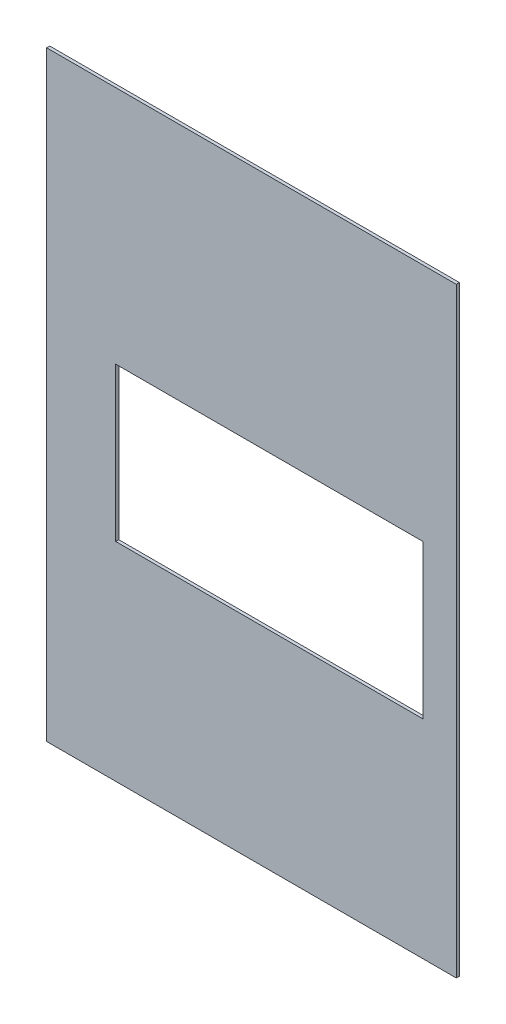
ISO-10303-21;
HEADER;
FILE_DESCRIPTION(('STEP AP214'),'2;1');
FILE_NAME('part.step','',(''),(''),'','','');
FILE_SCHEMA(('AUTOMOTIVE_DESIGN { 1 0 10303 214 1 1 1 1 }'));
ENDSEC;
DATA;
#1=APPLICATION_CONTEXT('core data for automotive mechanical design processes');
#2=APPLICATION_PROTOCOL_DEFINITION('international standard','automotive_design',2000,#1);
#3=PRODUCT_CONTEXT('',#1,'mechanical');
#4=PRODUCT('Part','Part','',(#3));
#5=PRODUCT_RELATED_PRODUCT_CATEGORY('part','',(#4));
#6=PRODUCT_DEFINITION_FORMATION('','',#4);
#7=PRODUCT_DEFINITION_CONTEXT('part definition',#1,'design');
#8=PRODUCT_DEFINITION('design','',#6,#7);
#9=PRODUCT_DEFINITION_SHAPE('','',#8);
#10=(LENGTH_UNIT() NAMED_UNIT(*) SI_UNIT(.MILLI.,.METRE.));
#11=(NAMED_UNIT(*) PLANE_ANGLE_UNIT() SI_UNIT($,.RADIAN.));
#12=(NAMED_UNIT(*) SI_UNIT($,.STERADIAN.) SOLID_ANGLE_UNIT());
#13=UNCERTAINTY_MEASURE_WITH_UNIT(LENGTH_MEASURE(1.E-05),#10,'distance_accuracy_value','');
#14=(GEOMETRIC_REPRESENTATION_CONTEXT(3) GLOBAL_UNCERTAINTY_ASSIGNED_CONTEXT((#13)) GLOBAL_UNIT_ASSIGNED_CONTEXT((#10,
#11,#12)) REPRESENTATION_CONTEXT('',''));
#15=CARTESIAN_POINT('',(0.,0.,0.));
#16=DIRECTION('',(0.,0.,1.));
#17=DIRECTION('',(1.,0.,0.));
#18=AXIS2_PLACEMENT_3D('',#15,#16,#17);
#19=CARTESIAN_POINT('',(0.,0.,10.));
#20=DIRECTION('',(0.,0.,1.));
#21=DIRECTION('',(1.,0.,0.));
#22=AXIS2_PLACEMENT_3D('',#19,#20,#21);
#23=PLANE('',#22);
#24=DIRECTION('',(0.,-1.,0.));
#25=VECTOR('',#24,1.);
#26=CARTESIAN_POINT('',(-2.22044604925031E-13,1955.8,10.));
#27=LINE('',#26,#25);
#28=CARTESIAN_POINT('',(-2.22044604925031E-13,1955.8,10.));
#29=VERTEX_POINT('',#28);
#30=CARTESIAN_POINT('',(0.,0.,10.));
#31=VERTEX_POINT('',#30);
#32=EDGE_CURVE('E133',#29,#31,#27,.T.);
#33=ORIENTED_EDGE('',*,*,#32,.T.);
#34=DIRECTION('',(1.,0.,0.));
#35=VECTOR('',#34,1.);
#36=CARTESIAN_POINT('',(0.,0.,10.));
#37=LINE('',#36,#35);
#38=CARTESIAN_POINT('',(1333.5,0.,10.));
#39=VERTEX_POINT('',#38);
#40=EDGE_CURVE('E136',#31,#39,#37,.T.);
#41=ORIENTED_EDGE('',*,*,#40,.T.);
#42=DIRECTION('',(0.,1.,0.));
#43=VECTOR('',#42,1.);
#44=CARTESIAN_POINT('',(1333.5,1955.8,10.));
#45=LINE('',#44,#43);
#46=CARTESIAN_POINT('',(1333.5,1955.8,10.));
#47=VERTEX_POINT('',#46);
#48=EDGE_CURVE('E139',#39,#47,#45,.T.);
#49=ORIENTED_EDGE('',*,*,#48,.T.);
#50=DIRECTION('',(-1.,0.,0.));
#51=VECTOR('',#50,1.);
#52=CARTESIAN_POINT('',(-2.22044604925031E-13,1955.8,10.));
#53=LINE('',#52,#51);
#54=EDGE_CURVE('E141',#47,#29,#53,.T.);
#55=ORIENTED_EDGE('',*,*,#54,.T.);
#56=EDGE_LOOP('',(#33,#41,#49,#55));
#57=FACE_BOUND('',#56,.T.);
#58=DIRECTION('',(1.,0.,0.));
#59=VECTOR('',#58,1.);
#60=CARTESIAN_POINT('',(224.793314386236,676.318527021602,10.));
#61=LINE('',#60,#59);
#62=CARTESIAN_POINT('',(224.793314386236,676.318527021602,10.));
#63=VERTEX_POINT('',#62);
#64=CARTESIAN_POINT('',(1224.79331438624,676.318527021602,10.));
#65=VERTEX_POINT('',#64);
#66=EDGE_CURVE('E105',#63,#65,#61,.T.);
#67=ORIENTED_EDGE('',*,*,#66,.F.);
#68=DIRECTION('',(0.,-1.,0.));
#69=VECTOR('',#68,1.);
#70=CARTESIAN_POINT('',(224.793314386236,1176.3185270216,10.));
#71=LINE('',#70,#69);
#72=CARTESIAN_POINT('',(224.793314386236,1176.3185270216,10.));
#73=VERTEX_POINT('',#72);
#74=EDGE_CURVE('E97',#73,#63,#71,.T.);
#75=ORIENTED_EDGE('',*,*,#74,.F.);
#76=DIRECTION('',(-1.,0.,0.));
#77=VECTOR('',#76,1.);
#78=CARTESIAN_POINT('',(224.793314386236,1176.3185270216,10.));
#79=LINE('',#78,#77);
#80=CARTESIAN_POINT('',(1224.79331438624,1176.3185270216,10.));
#81=VERTEX_POINT('',#80);
#82=EDGE_CURVE('E119',#81,#73,#79,.T.);
#83=ORIENTED_EDGE('',*,*,#82,.F.);
#84=DIRECTION('',(0.,1.,0.));
#85=VECTOR('',#84,1.);
#86=CARTESIAN_POINT('',(1224.79331438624,1176.3185270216,10.));
#87=LINE('',#86,#85);
#88=EDGE_CURVE('E117',#65,#81,#87,.T.);
#89=ORIENTED_EDGE('',*,*,#88,.F.);
#90=EDGE_LOOP('',(#67,#75,#83,#89));
#91=FACE_BOUND('',#90,.T.);
#92=ADVANCED_FACE('F32',(#57,#91),#23,.T.);
#93=CARTESIAN_POINT('',(0.,0.,0.));
#94=DIRECTION('',(0.,0.,1.));
#95=DIRECTION('',(1.,0.,0.));
#96=AXIS2_PLACEMENT_3D('',#93,#94,#95);
#97=PLANE('',#96);
#98=DIRECTION('',(0.,-1.,0.));
#99=VECTOR('',#98,1.);
#100=CARTESIAN_POINT('',(-2.22044604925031E-13,1955.8,0.));
#101=LINE('',#100,#99);
#102=CARTESIAN_POINT('',(-2.22044604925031E-13,1955.8,0.));
#103=VERTEX_POINT('',#102);
#104=CARTESIAN_POINT('',(0.,0.,0.));
#105=VERTEX_POINT('',#104);
#106=EDGE_CURVE('E113',#103,#105,#101,.T.);
#107=ORIENTED_EDGE('',*,*,#106,.F.);
#108=DIRECTION('',(-1.,0.,0.));
#109=VECTOR('',#108,1.);
#110=CARTESIAN_POINT('',(-2.22044604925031E-13,1955.8,0.));
#111=LINE('',#110,#109);
#112=CARTESIAN_POINT('',(1333.5,1955.8,0.));
#113=VERTEX_POINT('',#112);
#114=EDGE_CURVE('E137',#113,#103,#111,.T.);
#115=ORIENTED_EDGE('',*,*,#114,.F.);
#116=DIRECTION('',(0.,1.,0.));
#117=VECTOR('',#116,1.);
#118=CARTESIAN_POINT('',(1333.5,1955.8,0.));
#119=LINE('',#118,#117);
#120=CARTESIAN_POINT('',(1333.5,0.,0.));
#121=VERTEX_POINT('',#120);
#122=EDGE_CURVE('E148',#121,#113,#119,.T.);
#123=ORIENTED_EDGE('',*,*,#122,.F.);
#124=DIRECTION('',(1.,0.,0.));
#125=VECTOR('',#124,1.);
#126=CARTESIAN_POINT('',(0.,0.,0.));
#127=LINE('',#126,#125);
#128=EDGE_CURVE('E146',#105,#121,#127,.T.);
#129=ORIENTED_EDGE('',*,*,#128,.F.);
#130=EDGE_LOOP('',(#107,#115,#123,#129));
#131=FACE_BOUND('',#130,.T.);
#132=DIRECTION('',(0.,-1.,0.));
#133=VECTOR('',#132,1.);
#134=CARTESIAN_POINT('',(224.793314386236,1176.3185270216,0.));
#135=LINE('',#134,#133);
#136=CARTESIAN_POINT('',(224.793314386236,1176.3185270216,0.));
#137=VERTEX_POINT('',#136);
#138=CARTESIAN_POINT('',(224.793314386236,676.318527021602,0.));
#139=VERTEX_POINT('',#138);
#140=EDGE_CURVE('E55',#137,#139,#135,.T.);
#141=ORIENTED_EDGE('',*,*,#140,.T.);
#142=DIRECTION('',(1.,0.,0.));
#143=VECTOR('',#142,1.);
#144=CARTESIAN_POINT('',(224.793314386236,676.318527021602,0.));
#145=LINE('',#144,#143);
#146=CARTESIAN_POINT('',(1224.79331438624,676.318527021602,0.));
#147=VERTEX_POINT('',#146);
#148=EDGE_CURVE('E112',#139,#147,#145,.T.);
#149=ORIENTED_EDGE('',*,*,#148,.T.);
#150=DIRECTION('',(0.,1.,0.));
#151=VECTOR('',#150,1.);
#152=CARTESIAN_POINT('',(1224.79331438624,1176.3185270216,0.));
#153=LINE('',#152,#151);
#154=CARTESIAN_POINT('',(1224.79331438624,1176.3185270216,0.));
#155=VERTEX_POINT('',#154);
#156=EDGE_CURVE('E125',#147,#155,#153,.T.);
#157=ORIENTED_EDGE('',*,*,#156,.T.);
#158=DIRECTION('',(-1.,0.,0.));
#159=VECTOR('',#158,1.);
#160=CARTESIAN_POINT('',(224.793314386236,1176.3185270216,0.));
#161=LINE('',#160,#159);
#162=EDGE_CURVE('E106',#155,#137,#161,.T.);
#163=ORIENTED_EDGE('',*,*,#162,.T.);
#164=EDGE_LOOP('',(#141,#149,#157,#163));
#165=FACE_BOUND('',#164,.T.);
#166=ADVANCED_FACE('F166',(#131,#165),#97,.F.);
#167=CARTESIAN_POINT('',(-2.22044604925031E-13,1955.8,10.));
#168=DIRECTION('',(1.,0.,0.));
#169=DIRECTION('',(0.,1.,0.));
#170=AXIS2_PLACEMENT_3D('',#167,#168,#169);
#171=PLANE('',#170);
#172=ORIENTED_EDGE('',*,*,#106,.T.);
#173=DIRECTION('',(0.,0.,-1.));
#174=VECTOR('',#173,1.);
#175=CARTESIAN_POINT('',(0.,0.,10.));
#176=LINE('',#175,#174);
#177=EDGE_CURVE('E11',#31,#105,#176,.T.);
#178=ORIENTED_EDGE('',*,*,#177,.F.);
#179=ORIENTED_EDGE('',*,*,#32,.F.);
#180=DIRECTION('',(0.,0.,-1.));
#181=VECTOR('',#180,1.);
#182=CARTESIAN_POINT('',(-2.22044604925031E-13,1955.8,10.));
#183=LINE('',#182,#181);
#184=EDGE_CURVE('E143',#29,#103,#183,.T.);
#185=ORIENTED_EDGE('',*,*,#184,.T.);
#186=EDGE_LOOP('',(#172,#178,#179,#185));
#187=FACE_BOUND('',#186,.T.);
#188=ADVANCED_FACE('F34',(#187),#171,.F.);
#189=CARTESIAN_POINT('',(0.,0.,10.));
#190=DIRECTION('',(0.,1.,0.));
#191=DIRECTION('',(0.,0.,1.));
#192=AXIS2_PLACEMENT_3D('',#189,#190,#191);
#193=PLANE('',#192);
#194=ORIENTED_EDGE('',*,*,#128,.T.);
#195=DIRECTION('',(0.,0.,-1.));
#196=VECTOR('',#195,1.);
#197=CARTESIAN_POINT('',(1333.5,0.,10.));
#198=LINE('',#197,#196);
#199=EDGE_CURVE('E40',#39,#121,#198,.T.);
#200=ORIENTED_EDGE('',*,*,#199,.F.);
#201=ORIENTED_EDGE('',*,*,#40,.F.);
#202=ORIENTED_EDGE('',*,*,#177,.T.);
#203=EDGE_LOOP('',(#194,#200,#201,#202));
#204=FACE_BOUND('',#203,.T.);
#205=ADVANCED_FACE('F176',(#204),#193,.F.);
#206=CARTESIAN_POINT('',(1333.5,1955.8,10.));
#207=DIRECTION('',(-1.,0.,0.));
#208=DIRECTION('',(0.,-1.,0.));
#209=AXIS2_PLACEMENT_3D('',#206,#207,#208);
#210=PLANE('',#209);
#211=ORIENTED_EDGE('',*,*,#122,.T.);
#212=DIRECTION('',(0.,0.,-1.));
#213=VECTOR('',#212,1.);
#214=CARTESIAN_POINT('',(1333.5,1955.8,10.));
#215=LINE('',#214,#213);
#216=EDGE_CURVE('E153',#47,#113,#215,.T.);
#217=ORIENTED_EDGE('',*,*,#216,.F.);
#218=ORIENTED_EDGE('',*,*,#48,.F.);
#219=ORIENTED_EDGE('',*,*,#199,.T.);
#220=EDGE_LOOP('',(#211,#217,#218,#219));
#221=FACE_BOUND('',#220,.T.);
#222=ADVANCED_FACE('F160',(#221),#210,.F.);
#223=CARTESIAN_POINT('',(-2.22044604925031E-13,1955.8,10.));
#224=DIRECTION('',(0.,-1.,0.));
#225=DIRECTION('',(0.,0.,-1.));
#226=AXIS2_PLACEMENT_3D('',#223,#224,#225);
#227=PLANE('',#226);
#228=ORIENTED_EDGE('',*,*,#114,.T.);
#229=ORIENTED_EDGE('',*,*,#184,.F.);
#230=ORIENTED_EDGE('',*,*,#54,.F.);
#231=ORIENTED_EDGE('',*,*,#216,.T.);
#232=EDGE_LOOP('',(#228,#229,#230,#231));
#233=FACE_BOUND('',#232,.T.);
#234=ADVANCED_FACE('F170',(#233),#227,.F.);
#235=CARTESIAN_POINT('',(224.793314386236,1176.3185270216,10.));
#236=DIRECTION('',(1.,0.,0.));
#237=DIRECTION('',(0.,1.,0.));
#238=AXIS2_PLACEMENT_3D('',#235,#236,#237);
#239=PLANE('',#238);
#240=ORIENTED_EDGE('',*,*,#140,.F.);
#241=DIRECTION('',(0.,0.,-1.));
#242=VECTOR('',#241,1.);
#243=CARTESIAN_POINT('',(224.793314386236,1176.3185270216,10.));
#244=LINE('',#243,#242);
#245=EDGE_CURVE('E101',#73,#137,#244,.T.);
#246=ORIENTED_EDGE('',*,*,#245,.F.);
#247=ORIENTED_EDGE('',*,*,#74,.T.);
#248=DIRECTION('',(0.,0.,-1.));
#249=VECTOR('',#248,1.);
#250=CARTESIAN_POINT('',(224.793314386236,676.318527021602,10.));
#251=LINE('',#250,#249);
#252=EDGE_CURVE('E100',#63,#139,#251,.T.);
#253=ORIENTED_EDGE('',*,*,#252,.T.);
#254=EDGE_LOOP('',(#240,#246,#247,#253));
#255=FACE_BOUND('',#254,.T.);
#256=ADVANCED_FACE('F99',(#255),#239,.T.);
#257=CARTESIAN_POINT('',(224.793314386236,676.318527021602,10.));
#258=DIRECTION('',(0.,1.,0.));
#259=DIRECTION('',(-1.,0.,0.));
#260=AXIS2_PLACEMENT_3D('',#257,#258,#259);
#261=PLANE('',#260);
#262=ORIENTED_EDGE('',*,*,#148,.F.);
#263=ORIENTED_EDGE('',*,*,#252,.F.);
#264=ORIENTED_EDGE('',*,*,#66,.T.);
#265=DIRECTION('',(0.,0.,-1.));
#266=VECTOR('',#265,1.);
#267=CARTESIAN_POINT('',(1224.79331438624,676.318527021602,10.));
#268=LINE('',#267,#266);
#269=EDGE_CURVE('E114',#65,#147,#268,.T.);
#270=ORIENTED_EDGE('',*,*,#269,.T.);
#271=EDGE_LOOP('',(#262,#263,#264,#270));
#272=FACE_BOUND('',#271,.T.);
#273=ADVANCED_FACE('F109',(#272),#261,.T.);
#274=CARTESIAN_POINT('',(1224.79331438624,1176.3185270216,10.));
#275=DIRECTION('',(-1.,0.,0.));
#276=DIRECTION('',(0.,0.,1.));
#277=AXIS2_PLACEMENT_3D('',#274,#275,#276);
#278=PLANE('',#277);
#279=ORIENTED_EDGE('',*,*,#156,.F.);
#280=ORIENTED_EDGE('',*,*,#269,.F.);
#281=ORIENTED_EDGE('',*,*,#88,.T.);
#282=DIRECTION('',(0.,0.,-1.));
#283=VECTOR('',#282,1.);
#284=CARTESIAN_POINT('',(1224.79331438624,1176.3185270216,10.));
#285=LINE('',#284,#283);
#286=EDGE_CURVE('E47',#81,#155,#285,.T.);
#287=ORIENTED_EDGE('',*,*,#286,.T.);
#288=EDGE_LOOP('',(#279,#280,#281,#287));
#289=FACE_BOUND('',#288,.T.);
#290=ADVANCED_FACE('F199',(#289),#278,.T.);
#291=CARTESIAN_POINT('',(224.793314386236,1176.3185270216,10.));
#292=DIRECTION('',(0.,-1.,0.));
#293=DIRECTION('',(0.,0.,-1.));
#294=AXIS2_PLACEMENT_3D('',#291,#292,#293);
#295=PLANE('',#294);
#296=ORIENTED_EDGE('',*,*,#162,.F.);
#297=ORIENTED_EDGE('',*,*,#286,.F.);
#298=ORIENTED_EDGE('',*,*,#82,.T.);
#299=ORIENTED_EDGE('',*,*,#245,.T.);
#300=EDGE_LOOP('',(#296,#297,#298,#299));
#301=FACE_BOUND('',#300,.T.);
#302=ADVANCED_FACE('F203',(#301),#295,.T.);
#303=CLOSED_SHELL('',(#92,#166,#188,#205,#222,#234,#256,#273,#290,#302));
#304=MANIFOLD_SOLID_BREP('B2',#303);
#305=ADVANCED_BREP_SHAPE_REPRESENTATION('',(#18,#304),#14);
#306=SHAPE_DEFINITION_REPRESENTATION(#9,#305);
ENDSEC;
END-ISO-10303-21;
